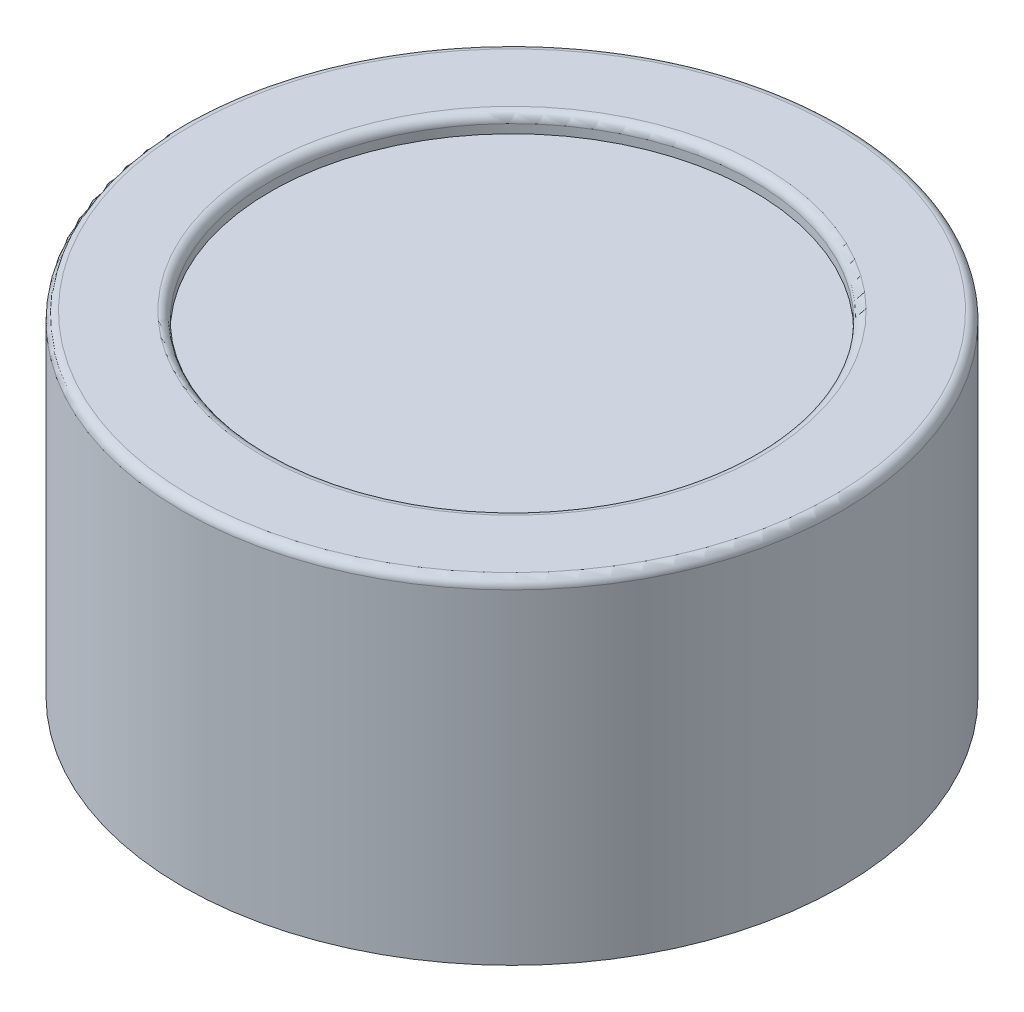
from build123d import *

# Parameters (mm, degrees)
SKETCH1_R           = 18.75
BOSS_EXTRUDE1_DEPTH = 19
SKETCH2_4_R         = 13.75
CUT_EXTRUDE2_DEPTH  = 1
FILLET1_R           = 0.5


with BuildPart() as part:
    # Sketch1 → Boss-Extrude1 (new body)
    with BuildSketch(Plane(origin=(0, 0, 0), x_dir=(1, 0, 0), z_dir=(0, 1, 0))):
        with Locations(Location((0, 0, 0), (0, 0, 270))):
            Circle(SKETCH1_R)
    extrude(amount=BOSS_EXTRUDE1_DEPTH)

    # Sketch2_4 → Cut-Extrude2 (cut)
    with BuildSketch(Plane(origin=(0, 19, 0), x_dir=(1, 0, 0), z_dir=(0, 1, 0))):
        with Locations(Location((0, 0, 0), (0, 0, 270))):
            Circle(SKETCH2_4_R)
    extrude(amount=-CUT_EXTRUDE2_DEPTH, mode=Mode.SUBTRACT)

    # Fillet1
    fillet1_edges = [part.edges().sort_by_distance(p)[0] for p in [
        (0, 19, -18.75),
        (0, 19, -13.75),
    ]]
    fillet(fillet1_edges, radius=FILLET1_R)


solid = part.part
